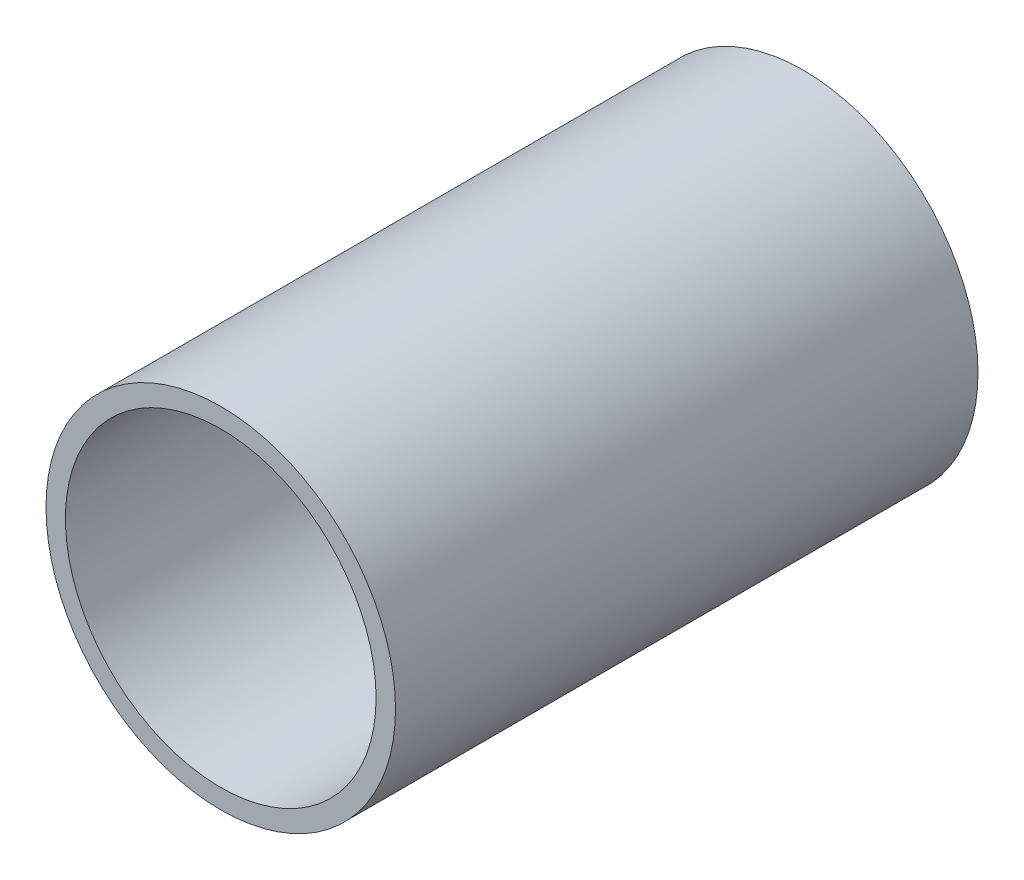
ISO-10303-21;
HEADER;
FILE_DESCRIPTION(('STEP AP214'),'2;1');
FILE_NAME('part.step','',(''),(''),'','','');
FILE_SCHEMA(('AUTOMOTIVE_DESIGN { 1 0 10303 214 1 1 1 1 }'));
ENDSEC;
DATA;
#1=APPLICATION_CONTEXT('core data for automotive mechanical design processes');
#2=APPLICATION_PROTOCOL_DEFINITION('international standard','automotive_design',2000,#1);
#3=PRODUCT_CONTEXT('',#1,'mechanical');
#4=PRODUCT('Part','Part','',(#3));
#5=PRODUCT_RELATED_PRODUCT_CATEGORY('part','',(#4));
#6=PRODUCT_DEFINITION_FORMATION('','',#4);
#7=PRODUCT_DEFINITION_CONTEXT('part definition',#1,'design');
#8=PRODUCT_DEFINITION('design','',#6,#7);
#9=PRODUCT_DEFINITION_SHAPE('','',#8);
#10=(LENGTH_UNIT() NAMED_UNIT(*) SI_UNIT(.MILLI.,.METRE.));
#11=(NAMED_UNIT(*) PLANE_ANGLE_UNIT() SI_UNIT($,.RADIAN.));
#12=(NAMED_UNIT(*) SI_UNIT($,.STERADIAN.) SOLID_ANGLE_UNIT());
#13=UNCERTAINTY_MEASURE_WITH_UNIT(LENGTH_MEASURE(1.E-05),#10,'distance_accuracy_value','');
#14=(GEOMETRIC_REPRESENTATION_CONTEXT(3) GLOBAL_UNCERTAINTY_ASSIGNED_CONTEXT((#13)) GLOBAL_UNIT_ASSIGNED_CONTEXT((#10,
#11,#12)) REPRESENTATION_CONTEXT('',''));
#15=CARTESIAN_POINT('',(0.,0.,0.));
#16=DIRECTION('',(0.,0.,1.));
#17=DIRECTION('',(1.,0.,0.));
#18=AXIS2_PLACEMENT_3D('',#15,#16,#17);
#19=CARTESIAN_POINT('',(0.,0.,120.));
#20=DIRECTION('',(0.,0.,1.));
#21=DIRECTION('',(1.,0.,0.));
#22=AXIS2_PLACEMENT_3D('',#19,#20,#21);
#23=PLANE('',#22);
#24=CARTESIAN_POINT('',(0.,0.,120.));
#25=DIRECTION('',(0.,0.,1.));
#26=DIRECTION('',(1.,0.,0.));
#27=AXIS2_PLACEMENT_3D('',#24,#25,#26);
#28=CIRCLE('',#27,36.);
#29=CARTESIAN_POINT('',(36.,0.,120.));
#30=VERTEX_POINT('',#29);
#31=EDGE_CURVE('E10',#30,#30,#28,.T.);
#32=ORIENTED_EDGE('',*,*,#31,.T.);
#33=EDGE_LOOP('',(#32));
#34=FACE_BOUND('',#33,.T.);
#35=CARTESIAN_POINT('',(0.,0.,120.));
#36=DIRECTION('',(0.,0.,1.));
#37=DIRECTION('',(1.,0.,0.));
#38=AXIS2_PLACEMENT_3D('',#35,#36,#37);
#39=CIRCLE('',#38,32.);
#40=CARTESIAN_POINT('',(32.,0.,120.));
#41=VERTEX_POINT('',#40);
#42=EDGE_CURVE('E40',#41,#41,#39,.T.);
#43=ORIENTED_EDGE('',*,*,#42,.F.);
#44=EDGE_LOOP('',(#43));
#45=FACE_BOUND('',#44,.T.);
#46=ADVANCED_FACE('F29',(#34,#45),#23,.T.);
#47=CARTESIAN_POINT('',(0.,0.,0.));
#48=DIRECTION('',(0.,0.,1.));
#49=DIRECTION('',(1.,0.,0.));
#50=AXIS2_PLACEMENT_3D('',#47,#48,#49);
#51=PLANE('',#50);
#52=CARTESIAN_POINT('',(0.,0.,0.));
#53=DIRECTION('',(0.,0.,1.));
#54=DIRECTION('',(1.,0.,0.));
#55=AXIS2_PLACEMENT_3D('',#52,#53,#54);
#56=CIRCLE('',#55,36.);
#57=CARTESIAN_POINT('',(36.,0.,0.));
#58=VERTEX_POINT('',#57);
#59=EDGE_CURVE('E36',#58,#58,#56,.T.);
#60=ORIENTED_EDGE('',*,*,#59,.F.);
#61=EDGE_LOOP('',(#60));
#62=FACE_BOUND('',#61,.T.);
#63=CARTESIAN_POINT('',(0.,0.,0.));
#64=DIRECTION('',(0.,0.,1.));
#65=DIRECTION('',(1.,0.,0.));
#66=AXIS2_PLACEMENT_3D('',#63,#64,#65);
#67=CIRCLE('',#66,32.);
#68=CARTESIAN_POINT('',(32.,0.,0.));
#69=VERTEX_POINT('',#68);
#70=EDGE_CURVE('E44',#69,#69,#67,.T.);
#71=ORIENTED_EDGE('',*,*,#70,.T.);
#72=EDGE_LOOP('',(#71));
#73=FACE_BOUND('',#72,.T.);
#74=ADVANCED_FACE('F50',(#62,#73),#51,.F.);
#75=CARTESIAN_POINT('',(0.,0.,120.));
#76=DIRECTION('',(0.,0.,-1.));
#77=DIRECTION('',(-1.,0.,0.));
#78=AXIS2_PLACEMENT_3D('',#75,#76,#77);
#79=CYLINDRICAL_SURFACE('',#78,36.);
#80=ORIENTED_EDGE('',*,*,#31,.F.);
#81=EDGE_LOOP('',(#80));
#82=FACE_BOUND('',#81,.T.);
#83=ORIENTED_EDGE('',*,*,#59,.T.);
#84=EDGE_LOOP('',(#83));
#85=FACE_BOUND('',#84,.T.);
#86=ADVANCED_FACE('F31',(#82,#85),#79,.T.);
#87=CARTESIAN_POINT('',(0.,0.,120.));
#88=DIRECTION('',(0.,0.,-1.));
#89=DIRECTION('',(-1.,0.,0.));
#90=AXIS2_PLACEMENT_3D('',#87,#88,#89);
#91=CYLINDRICAL_SURFACE('',#90,32.);
#92=ORIENTED_EDGE('',*,*,#42,.T.);
#93=EDGE_LOOP('',(#92));
#94=FACE_BOUND('',#93,.T.);
#95=ORIENTED_EDGE('',*,*,#70,.F.);
#96=EDGE_LOOP('',(#95));
#97=FACE_BOUND('',#96,.T.);
#98=ADVANCED_FACE('F52',(#94,#97),#91,.F.);
#99=CLOSED_SHELL('',(#46,#74,#86,#98));
#100=MANIFOLD_SOLID_BREP('B2',#99);
#101=ADVANCED_BREP_SHAPE_REPRESENTATION('',(#18,#100),#14);
#102=SHAPE_DEFINITION_REPRESENTATION(#9,#101);
ENDSEC;
END-ISO-10303-21;
